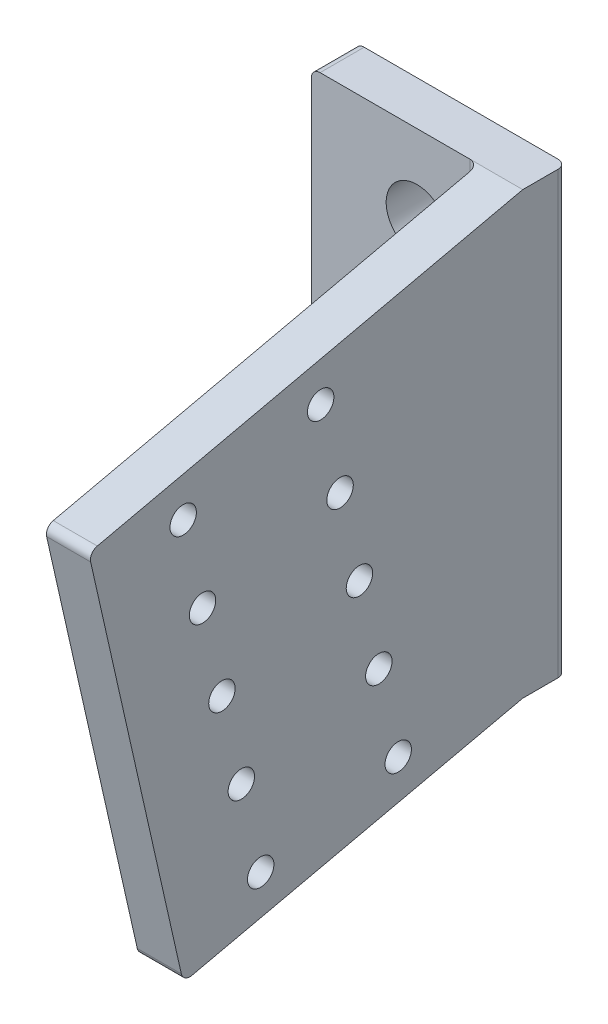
ISO-10303-21;
HEADER;
FILE_DESCRIPTION(('STEP AP214'),'2;1');
FILE_NAME('part.step','',(''),(''),'','','');
FILE_SCHEMA(('AUTOMOTIVE_DESIGN { 1 0 10303 214 1 1 1 1 }'));
ENDSEC;
DATA;
#1=APPLICATION_CONTEXT('core data for automotive mechanical design processes');
#2=APPLICATION_PROTOCOL_DEFINITION('international standard','automotive_design',2000,#1);
#3=PRODUCT_CONTEXT('',#1,'mechanical');
#4=PRODUCT('Part','Part','',(#3));
#5=PRODUCT_RELATED_PRODUCT_CATEGORY('part','',(#4));
#6=PRODUCT_DEFINITION_FORMATION('','',#4);
#7=PRODUCT_DEFINITION_CONTEXT('part definition',#1,'design');
#8=PRODUCT_DEFINITION('design','',#6,#7);
#9=PRODUCT_DEFINITION_SHAPE('','',#8);
#10=(LENGTH_UNIT() NAMED_UNIT(*) SI_UNIT(.MILLI.,.METRE.));
#11=(NAMED_UNIT(*) PLANE_ANGLE_UNIT() SI_UNIT($,.RADIAN.));
#12=(NAMED_UNIT(*) SI_UNIT($,.STERADIAN.) SOLID_ANGLE_UNIT());
#13=UNCERTAINTY_MEASURE_WITH_UNIT(LENGTH_MEASURE(1.E-05),#10,'distance_accuracy_value','');
#14=(GEOMETRIC_REPRESENTATION_CONTEXT(3) GLOBAL_UNCERTAINTY_ASSIGNED_CONTEXT((#13)) GLOBAL_UNIT_ASSIGNED_CONTEXT((#10,
#11,#12)) REPRESENTATION_CONTEXT('',''));
#15=CARTESIAN_POINT('',(0.,0.,0.));
#16=DIRECTION('',(0.,0.,1.));
#17=DIRECTION('',(1.,0.,0.));
#18=AXIS2_PLACEMENT_3D('',#15,#16,#17);
#19=CARTESIAN_POINT('',(-92.5,0.,5.));
#20=DIRECTION('',(-1.,0.,0.));
#21=DIRECTION('',(0.,0.,1.));
#22=AXIS2_PLACEMENT_3D('',#19,#20,#21);
#23=PLANE('',#22);
#24=CARTESIAN_POINT('',(-92.5,5.57499871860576,25.7344975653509));
#25=DIRECTION('',(-1.,0.,0.));
#26=DIRECTION('',(0.,0.,1.));
#27=AXIS2_PLACEMENT_3D('',#24,#25,#26);
#28=CIRCLE('',#27,1.5);
#29=CARTESIAN_POINT('',(-92.5,5.57499871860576,27.2344975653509));
#30=VERTEX_POINT('',#29);
#31=EDGE_CURVE('E298',#30,#30,#28,.T.);
#32=ORIENTED_EDGE('',*,*,#31,.T.);
#33=EDGE_LOOP('',(#32));
#34=FACE_BOUND('',#33,.T.);
#35=CARTESIAN_POINT('',(-92.5,-13.9349987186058,21.3344975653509));
#36=DIRECTION('',(-1.,0.,0.));
#37=DIRECTION('',(0.,0.,1.));
#38=AXIS2_PLACEMENT_3D('',#35,#36,#37);
#39=CIRCLE('',#38,1.5);
#40=CARTESIAN_POINT('',(-92.5,-13.9349987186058,22.8344975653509));
#41=VERTEX_POINT('',#40);
#42=EDGE_CURVE('E282',#41,#41,#39,.T.);
#43=ORIENTED_EDGE('',*,*,#42,.T.);
#44=EDGE_LOOP('',(#43));
#45=FACE_BOUND('',#44,.T.);
#46=DIRECTION('',(0.,0.,-1.));
#47=VECTOR('',#46,1.);
#48=CARTESIAN_POINT('',(-92.5,-24.9999999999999,5.));
#49=LINE('',#48,#47);
#50=CARTESIAN_POINT('',(-92.5,-24.9999999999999,5.));
#51=VERTEX_POINT('',#50);
#52=CARTESIAN_POINT('',(-92.5,-24.9999999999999,1.));
#53=VERTEX_POINT('',#52);
#54=EDGE_CURVE('E204',#51,#53,#49,.T.);
#55=ORIENTED_EDGE('',*,*,#54,.T.);
#56=DIRECTION('',(0.,1.,0.));
#57=VECTOR('',#56,1.);
#58=CARTESIAN_POINT('',(-92.5,0.,1.));
#59=LINE('',#58,#57);
#60=CARTESIAN_POINT('',(-92.5,24.9999999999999,1.));
#61=VERTEX_POINT('',#60);
#62=EDGE_CURVE('E202',#53,#61,#59,.T.);
#63=ORIENTED_EDGE('',*,*,#62,.T.);
#64=DIRECTION('',(0.,0.,-1.));
#65=VECTOR('',#64,1.);
#66=CARTESIAN_POINT('',(-92.5,24.9999999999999,5.));
#67=LINE('',#66,#65);
#68=CARTESIAN_POINT('',(-92.5,25.,5.));
#69=VERTEX_POINT('',#68);
#70=EDGE_CURVE('E198',#69,#61,#67,.T.);
#71=ORIENTED_EDGE('',*,*,#70,.F.);
#72=DIRECTION('',(0.,0.220000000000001,-0.975499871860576));
#73=VECTOR('',#72,1.);
#74=CARTESIAN_POINT('',(-92.5,23.7899999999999,10.3652492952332));
#75=LINE('',#74,#73);
#76=CARTESIAN_POINT('',(-92.5,14.1099999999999,53.2872436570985));
#77=VERTEX_POINT('',#76);
#78=EDGE_CURVE('E183',#77,#69,#75,.T.);
#79=ORIENTED_EDGE('',*,*,#78,.F.);
#80=CARTESIAN_POINT('',(-92.5,13.1345001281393,53.0672436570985));
#81=DIRECTION('',(-1.,0.,0.));
#82=DIRECTION('',(0.,0.,1.));
#83=AXIS2_PLACEMENT_3D('',#80,#81,#82);
#84=CIRCLE('',#83,1.);
#85=CARTESIAN_POINT('',(-92.5,12.9145001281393,54.0427435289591));
#86=VERTEX_POINT('',#85);
#87=EDGE_CURVE('E330',#77,#86,#84,.F.);
#88=ORIENTED_EDGE('',*,*,#87,.T.);
#89=DIRECTION('',(0.,-0.975499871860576,-0.220000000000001));
#90=VECTOR('',#89,1.);
#91=CARTESIAN_POINT('',(-92.5,-9.90000000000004,48.8974942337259));
#92=LINE('',#91,#90);
#93=CARTESIAN_POINT('',(-92.5,-32.7145001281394,43.7522449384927));
#94=VERTEX_POINT('',#93);
#95=EDGE_CURVE('E274',#86,#94,#92,.T.);
#96=ORIENTED_EDGE('',*,*,#95,.T.);
#97=CARTESIAN_POINT('',(-92.5,-32.4945001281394,42.7767450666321));
#98=DIRECTION('',(-1.,0.,0.));
#99=DIRECTION('',(0.,0.,1.));
#100=AXIS2_PLACEMENT_3D('',#97,#98,#99);
#101=CIRCLE('',#100,1.);
#102=CARTESIAN_POINT('',(-92.5,-33.47,42.5567450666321));
#103=VERTEX_POINT('',#102);
#104=EDGE_CURVE('E332',#94,#103,#101,.F.);
#105=ORIENTED_EDGE('',*,*,#104,.T.);
#106=DIRECTION('',(0.,0.220000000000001,-0.975499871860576));
#107=VECTOR('',#106,1.);
#108=CARTESIAN_POINT('',(-92.5,-23.7899999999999,-0.365249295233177));
#109=LINE('',#108,#107);
#110=EDGE_CURVE('E194',#103,#51,#109,.T.);
#111=ORIENTED_EDGE('',*,*,#110,.T.);
#112=EDGE_LOOP('',(#55,#63,#71,#79,#88,#96,#105,#111));
#113=FACE_BOUND('',#112,.T.);
#114=CARTESIAN_POINT('',(-92.5,-27.2099974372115,34.7424955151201));
#115=DIRECTION('',(-1.,0.,0.));
#116=DIRECTION('',(0.,0.,1.));
#117=AXIS2_PLACEMENT_3D('',#114,#115,#116);
#118=CIRCLE('',#117,1.5);
#119=CARTESIAN_POINT('',(-92.5,-27.2099974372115,36.2424955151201));
#120=VERTEX_POINT('',#119);
#121=EDGE_CURVE('E273',#120,#120,#118,.F.);
#122=ORIENTED_EDGE('',*,*,#121,.F.);
#123=EDGE_LOOP('',(#122));
#124=FACE_BOUND('',#123,.T.);
#125=CARTESIAN_POINT('',(-92.5,-23.6899974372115,19.1344975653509));
#126=DIRECTION('',(-1.,0.,0.));
#127=DIRECTION('',(0.,0.,1.));
#128=AXIS2_PLACEMENT_3D('',#125,#126,#127);
#129=CIRCLE('',#128,1.5);
#130=CARTESIAN_POINT('',(-92.5,-23.6899974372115,20.6344975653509));
#131=VERTEX_POINT('',#130);
#132=EDGE_CURVE('E278',#131,#131,#129,.T.);
#133=ORIENTED_EDGE('',*,*,#132,.T.);
#134=EDGE_LOOP('',(#133));
#135=FACE_BOUND('',#134,.T.);
#136=CARTESIAN_POINT('',(-92.5,-17.4549987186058,36.9424955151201));
#137=DIRECTION('',(-1.,0.,0.));
#138=DIRECTION('',(0.,0.,1.));
#139=AXIS2_PLACEMENT_3D('',#136,#137,#138);
#140=CIRCLE('',#139,1.5);
#141=CARTESIAN_POINT('',(-92.5,-17.4549987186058,38.4424955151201));
#142=VERTEX_POINT('',#141);
#143=EDGE_CURVE('E286',#142,#142,#140,.F.);
#144=ORIENTED_EDGE('',*,*,#143,.F.);
#145=EDGE_LOOP('',(#144));
#146=FACE_BOUND('',#145,.T.);
#147=CARTESIAN_POINT('',(-92.5,-7.70000000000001,39.1424955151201));
#148=DIRECTION('',(-1.,0.,0.));
#149=DIRECTION('',(0.,0.,1.));
#150=AXIS2_PLACEMENT_3D('',#147,#148,#149);
#151=CIRCLE('',#150,1.5);
#152=CARTESIAN_POINT('',(-92.5,-7.70000000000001,40.6424955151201));
#153=VERTEX_POINT('',#152);
#154=EDGE_CURVE('E290',#153,#153,#151,.F.);
#155=ORIENTED_EDGE('',*,*,#154,.F.);
#156=EDGE_LOOP('',(#155));
#157=FACE_BOUND('',#156,.T.);
#158=CARTESIAN_POINT('',(-92.5,-4.18,23.5344975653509));
#159=DIRECTION('',(-1.,0.,0.));
#160=DIRECTION('',(0.,0.,1.));
#161=AXIS2_PLACEMENT_3D('',#158,#159,#160);
#162=CIRCLE('',#161,1.5);
#163=CARTESIAN_POINT('',(-92.5,-4.18,25.0344975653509));
#164=VERTEX_POINT('',#163);
#165=EDGE_CURVE('E294',#164,#164,#162,.T.);
#166=ORIENTED_EDGE('',*,*,#165,.T.);
#167=EDGE_LOOP('',(#166));
#168=FACE_BOUND('',#167,.T.);
#169=CARTESIAN_POINT('',(-92.5,2.05499871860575,41.3424955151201));
#170=DIRECTION('',(-1.,0.,0.));
#171=DIRECTION('',(0.,0.,1.));
#172=AXIS2_PLACEMENT_3D('',#169,#170,#171);
#173=CIRCLE('',#172,1.5);
#174=CARTESIAN_POINT('',(-92.5,2.05499871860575,42.8424955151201));
#175=VERTEX_POINT('',#174);
#176=EDGE_CURVE('E302',#175,#175,#173,.F.);
#177=ORIENTED_EDGE('',*,*,#176,.F.);
#178=EDGE_LOOP('',(#177));
#179=FACE_BOUND('',#178,.T.);
#180=CARTESIAN_POINT('',(-92.5,11.8099974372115,43.5424955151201));
#181=DIRECTION('',(-1.,0.,0.));
#182=DIRECTION('',(0.,0.,1.));
#183=AXIS2_PLACEMENT_3D('',#180,#181,#182);
#184=CIRCLE('',#183,1.5);
#185=CARTESIAN_POINT('',(-92.5,11.8099974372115,45.0424955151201));
#186=VERTEX_POINT('',#185);
#187=EDGE_CURVE('E306',#186,#186,#184,.F.);
#188=ORIENTED_EDGE('',*,*,#187,.F.);
#189=EDGE_LOOP('',(#188));
#190=FACE_BOUND('',#189,.T.);
#191=CARTESIAN_POINT('',(-92.5,15.3299974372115,27.934497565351));
#192=DIRECTION('',(-1.,0.,0.));
#193=DIRECTION('',(0.,0.,1.));
#194=AXIS2_PLACEMENT_3D('',#191,#192,#193);
#195=CIRCLE('',#194,1.5);
#196=CARTESIAN_POINT('',(-92.5,15.3299974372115,29.434497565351));
#197=VERTEX_POINT('',#196);
#198=EDGE_CURVE('E310',#197,#197,#195,.T.);
#199=ORIENTED_EDGE('',*,*,#198,.T.);
#200=EDGE_LOOP('',(#199));
#201=FACE_BOUND('',#200,.T.);
#202=ADVANCED_FACE('F43',(#34,#45,#113,#124,#135,#146,#157,#168,#179,#190,#201),#23,.F.);
#203=CARTESIAN_POINT('',(-97.5,0.,0.));
#204=DIRECTION('',(-1.,0.,0.));
#205=DIRECTION('',(0.,0.,1.));
#206=AXIS2_PLACEMENT_3D('',#203,#204,#205);
#207=PLANE('',#206);
#208=DIRECTION('',(0.,0.220000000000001,-0.975499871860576));
#209=VECTOR('',#208,1.);
#210=CARTESIAN_POINT('',(-97.5,-23.7899999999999,-0.365249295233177));
#211=LINE('',#210,#209);
#212=CARTESIAN_POINT('',(-97.5,-33.47,42.5567450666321));
#213=VERTEX_POINT('',#212);
#214=CARTESIAN_POINT('',(-97.5,-25.2255254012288,6.));
#215=VERTEX_POINT('',#214);
#216=EDGE_CURVE('E193',#213,#215,#211,.T.);
#217=ORIENTED_EDGE('',*,*,#216,.F.);
#218=CARTESIAN_POINT('',(-97.5,-32.4945001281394,42.7767450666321));
#219=DIRECTION('',(-1.,0.,0.));
#220=DIRECTION('',(0.,0.,1.));
#221=AXIS2_PLACEMENT_3D('',#218,#219,#220);
#222=CIRCLE('',#221,1.);
#223=CARTESIAN_POINT('',(-97.5,-32.7145001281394,43.7522449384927));
#224=VERTEX_POINT('',#223);
#225=EDGE_CURVE('E369',#213,#224,#222,.T.);
#226=ORIENTED_EDGE('',*,*,#225,.T.);
#227=DIRECTION('',(0.,-0.975499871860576,-0.220000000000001));
#228=VECTOR('',#227,1.);
#229=CARTESIAN_POINT('',(-97.5,-10.9730498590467,48.6554942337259));
#230=LINE('',#229,#228);
#231=CARTESIAN_POINT('',(-97.5,12.9145001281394,54.0427435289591));
#232=VERTEX_POINT('',#231);
#233=EDGE_CURVE('E453',#232,#224,#230,.T.);
#234=ORIENTED_EDGE('',*,*,#233,.F.);
#235=CARTESIAN_POINT('',(-97.5,13.1345001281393,53.0672436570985));
#236=DIRECTION('',(-1.,0.,0.));
#237=DIRECTION('',(0.,0.,1.));
#238=AXIS2_PLACEMENT_3D('',#235,#236,#237);
#239=CIRCLE('',#238,1.);
#240=CARTESIAN_POINT('',(-97.5,14.1099999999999,53.2872436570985));
#241=VERTEX_POINT('',#240);
#242=EDGE_CURVE('E367',#232,#241,#239,.T.);
#243=ORIENTED_EDGE('',*,*,#242,.T.);
#244=DIRECTION('',(0.,0.220000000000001,-0.975499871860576));
#245=VECTOR('',#244,1.);
#246=CARTESIAN_POINT('',(-97.5,23.7899999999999,10.3652492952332));
#247=LINE('',#246,#245);
#248=CARTESIAN_POINT('',(-97.5,24.7744745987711,6.));
#249=VERTEX_POINT('',#248);
#250=EDGE_CURVE('E213',#241,#249,#247,.T.);
#251=ORIENTED_EDGE('',*,*,#250,.T.);
#252=DIRECTION('',(0.,-1.,0.));
#253=VECTOR('',#252,1.);
#254=CARTESIAN_POINT('',(-97.5,-24.9999999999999,6.));
#255=LINE('',#254,#253);
#256=EDGE_CURVE('E364',#249,#215,#255,.T.);
#257=ORIENTED_EDGE('',*,*,#256,.T.);
#258=EDGE_LOOP('',(#217,#226,#234,#243,#251,#257));
#259=FACE_BOUND('',#258,.T.);
#260=CARTESIAN_POINT('',(-97.5,11.8099974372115,43.5424955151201));
#261=DIRECTION('',(-1.,0.,0.));
#262=DIRECTION('',(0.,0.,1.));
#263=AXIS2_PLACEMENT_3D('',#260,#261,#262);
#264=CIRCLE('',#263,1.5);
#265=CARTESIAN_POINT('',(-97.5,11.8099974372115,45.0424955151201));
#266=VERTEX_POINT('',#265);
#267=EDGE_CURVE('E303',#266,#266,#264,.F.);
#268=ORIENTED_EDGE('',*,*,#267,.T.);
#269=EDGE_LOOP('',(#268));
#270=FACE_BOUND('',#269,.T.);
#271=CARTESIAN_POINT('',(-97.5,2.05499871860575,41.3424955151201));
#272=DIRECTION('',(-1.,0.,0.));
#273=DIRECTION('',(0.,0.,1.));
#274=AXIS2_PLACEMENT_3D('',#271,#272,#273);
#275=CIRCLE('',#274,1.5);
#276=CARTESIAN_POINT('',(-97.5,2.05499871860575,42.8424955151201));
#277=VERTEX_POINT('',#276);
#278=EDGE_CURVE('E299',#277,#277,#275,.F.);
#279=ORIENTED_EDGE('',*,*,#278,.T.);
#280=EDGE_LOOP('',(#279));
#281=FACE_BOUND('',#280,.T.);
#282=CARTESIAN_POINT('',(-97.5,-7.70000000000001,39.1424955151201));
#283=DIRECTION('',(-1.,0.,0.));
#284=DIRECTION('',(0.,0.,1.));
#285=AXIS2_PLACEMENT_3D('',#282,#283,#284);
#286=CIRCLE('',#285,1.5);
#287=CARTESIAN_POINT('',(-97.5,-7.70000000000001,40.6424955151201));
#288=VERTEX_POINT('',#287);
#289=EDGE_CURVE('E287',#288,#288,#286,.F.);
#290=ORIENTED_EDGE('',*,*,#289,.T.);
#291=EDGE_LOOP('',(#290));
#292=FACE_BOUND('',#291,.T.);
#293=CARTESIAN_POINT('',(-97.5,-17.4549987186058,36.9424955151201));
#294=DIRECTION('',(-1.,0.,0.));
#295=DIRECTION('',(0.,0.,1.));
#296=AXIS2_PLACEMENT_3D('',#293,#294,#295);
#297=CIRCLE('',#296,1.5);
#298=CARTESIAN_POINT('',(-97.5,-17.4549987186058,38.4424955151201));
#299=VERTEX_POINT('',#298);
#300=EDGE_CURVE('E283',#299,#299,#297,.F.);
#301=ORIENTED_EDGE('',*,*,#300,.T.);
#302=EDGE_LOOP('',(#301));
#303=FACE_BOUND('',#302,.T.);
#304=CARTESIAN_POINT('',(-97.5,-27.2099974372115,34.7424955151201));
#305=DIRECTION('',(-1.,0.,0.));
#306=DIRECTION('',(0.,0.,1.));
#307=AXIS2_PLACEMENT_3D('',#304,#305,#306);
#308=CIRCLE('',#307,1.5);
#309=CARTESIAN_POINT('',(-97.5,-27.2099974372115,36.2424955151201));
#310=VERTEX_POINT('',#309);
#311=EDGE_CURVE('E270',#310,#310,#308,.F.);
#312=ORIENTED_EDGE('',*,*,#311,.T.);
#313=EDGE_LOOP('',(#312));
#314=FACE_BOUND('',#313,.T.);
#315=CARTESIAN_POINT('',(-97.5,-23.6899974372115,19.1344975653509));
#316=DIRECTION('',(-1.,0.,0.));
#317=DIRECTION('',(0.,0.,1.));
#318=AXIS2_PLACEMENT_3D('',#315,#316,#317);
#319=CIRCLE('',#318,1.5);
#320=CARTESIAN_POINT('',(-97.5,-23.6899974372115,20.6344975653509));
#321=VERTEX_POINT('',#320);
#322=EDGE_CURVE('E275',#321,#321,#319,.T.);
#323=ORIENTED_EDGE('',*,*,#322,.F.);
#324=EDGE_LOOP('',(#323));
#325=FACE_BOUND('',#324,.T.);
#326=CARTESIAN_POINT('',(-97.5,-13.9349987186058,21.3344975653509));
#327=DIRECTION('',(-1.,0.,0.));
#328=DIRECTION('',(0.,0.,1.));
#329=AXIS2_PLACEMENT_3D('',#326,#327,#328);
#330=CIRCLE('',#329,1.5);
#331=CARTESIAN_POINT('',(-97.5,-13.9349987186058,22.8344975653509));
#332=VERTEX_POINT('',#331);
#333=EDGE_CURVE('E279',#332,#332,#330,.T.);
#334=ORIENTED_EDGE('',*,*,#333,.F.);
#335=EDGE_LOOP('',(#334));
#336=FACE_BOUND('',#335,.T.);
#337=CARTESIAN_POINT('',(-97.5,-4.18,23.5344975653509));
#338=DIRECTION('',(-1.,0.,0.));
#339=DIRECTION('',(0.,0.,1.));
#340=AXIS2_PLACEMENT_3D('',#337,#338,#339);
#341=CIRCLE('',#340,1.5);
#342=CARTESIAN_POINT('',(-97.5,-4.18,25.0344975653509));
#343=VERTEX_POINT('',#342);
#344=EDGE_CURVE('E291',#343,#343,#341,.T.);
#345=ORIENTED_EDGE('',*,*,#344,.F.);
#346=EDGE_LOOP('',(#345));
#347=FACE_BOUND('',#346,.T.);
#348=CARTESIAN_POINT('',(-97.5,5.57499871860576,25.7344975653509));
#349=DIRECTION('',(-1.,0.,0.));
#350=DIRECTION('',(0.,0.,1.));
#351=AXIS2_PLACEMENT_3D('',#348,#349,#350);
#352=CIRCLE('',#351,1.5);
#353=CARTESIAN_POINT('',(-97.5,5.57499871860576,27.2344975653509));
#354=VERTEX_POINT('',#353);
#355=EDGE_CURVE('E295',#354,#354,#352,.T.);
#356=ORIENTED_EDGE('',*,*,#355,.F.);
#357=EDGE_LOOP('',(#356));
#358=FACE_BOUND('',#357,.T.);
#359=CARTESIAN_POINT('',(-97.5,15.3299974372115,27.934497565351));
#360=DIRECTION('',(-1.,0.,0.));
#361=DIRECTION('',(0.,0.,1.));
#362=AXIS2_PLACEMENT_3D('',#359,#360,#361);
#363=CIRCLE('',#362,1.5);
#364=CARTESIAN_POINT('',(-97.5,15.3299974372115,29.434497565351));
#365=VERTEX_POINT('',#364);
#366=EDGE_CURVE('E307',#365,#365,#363,.T.);
#367=ORIENTED_EDGE('',*,*,#366,.F.);
#368=EDGE_LOOP('',(#367));
#369=FACE_BOUND('',#368,.T.);
#370=ADVANCED_FACE('F465',(#259,#270,#281,#292,#303,#314,#325,#336,#347,#358,#369),#207,.T.);
#371=CARTESIAN_POINT('',(0.,-24.9999999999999,5.));
#372=DIRECTION('',(0.,-1.,0.));
#373=DIRECTION('',(0.,0.,-1.));
#374=AXIS2_PLACEMENT_3D('',#371,#372,#373);
#375=PLANE('',#374);
#376=DIRECTION('',(-1.,0.,0.));
#377=VECTOR('',#376,1.);
#378=CARTESIAN_POINT('',(0.,-24.9999999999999,0.));
#379=LINE('',#378,#377);
#380=CARTESIAN_POINT('',(-93.5,-24.9999999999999,0.));
#381=VERTEX_POINT('',#380);
#382=CARTESIAN_POINT('',(-115.5,-24.9999999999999,0.));
#383=VERTEX_POINT('',#382);
#384=EDGE_CURVE('E254',#381,#383,#379,.T.);
#385=ORIENTED_EDGE('',*,*,#384,.F.);
#386=CARTESIAN_POINT('',(-93.5,-24.9999999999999,1.));
#387=DIRECTION('',(0.,-1.,0.));
#388=DIRECTION('',(0.,0.,-1.));
#389=AXIS2_PLACEMENT_3D('',#386,#387,#388);
#390=CIRCLE('',#389,1.);
#391=EDGE_CURVE('E348',#381,#53,#390,.T.);
#392=ORIENTED_EDGE('',*,*,#391,.T.);
#393=ORIENTED_EDGE('',*,*,#54,.F.);
#394=DIRECTION('',(-1.,0.,0.));
#395=VECTOR('',#394,1.);
#396=CARTESIAN_POINT('',(0.,-24.9999999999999,5.));
#397=LINE('',#396,#395);
#398=CARTESIAN_POINT('',(-98.5,-24.9999999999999,5.));
#399=VERTEX_POINT('',#398);
#400=EDGE_CURVE('E59',#51,#399,#397,.T.);
#401=ORIENTED_EDGE('',*,*,#400,.T.);
#402=CARTESIAN_POINT('',(-115.5,-24.9999999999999,5.));
#403=VERTEX_POINT('',#402);
#404=EDGE_CURVE('E235',#399,#403,#397,.T.);
#405=ORIENTED_EDGE('',*,*,#404,.T.);
#406=DIRECTION('',(0.,0.,-1.));
#407=VECTOR('',#406,1.);
#408=CARTESIAN_POINT('',(-115.5,-24.9999999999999,5.));
#409=LINE('',#408,#407);
#410=EDGE_CURVE('E345',#403,#383,#409,.T.);
#411=ORIENTED_EDGE('',*,*,#410,.T.);
#412=EDGE_LOOP('',(#385,#392,#393,#401,#405,#411));
#413=FACE_BOUND('',#412,.T.);
#414=ADVANCED_FACE('F408',(#413),#375,.T.);
#415=CARTESIAN_POINT('',(0.,24.9999999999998,5.));
#416=DIRECTION('',(0.,1.,0.));
#417=DIRECTION('',(-1.,0.,0.));
#418=AXIS2_PLACEMENT_3D('',#415,#416,#417);
#419=PLANE('',#418);
#420=ORIENTED_EDGE('',*,*,#70,.T.);
#421=CARTESIAN_POINT('',(-93.5,24.9999999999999,1.));
#422=DIRECTION('',(0.,1.,0.));
#423=DIRECTION('',(-1.,0.,0.));
#424=AXIS2_PLACEMENT_3D('',#421,#422,#423);
#425=CIRCLE('',#424,1.);
#426=CARTESIAN_POINT('',(-93.5,24.9999999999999,0.));
#427=VERTEX_POINT('',#426);
#428=EDGE_CURVE('E337',#61,#427,#425,.T.);
#429=ORIENTED_EDGE('',*,*,#428,.T.);
#430=DIRECTION('',(1.,0.,0.));
#431=VECTOR('',#430,1.);
#432=CARTESIAN_POINT('',(0.,24.9999999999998,0.));
#433=LINE('',#432,#431);
#434=CARTESIAN_POINT('',(-115.5,25.,0.));
#435=VERTEX_POINT('',#434);
#436=EDGE_CURVE('E257',#435,#427,#433,.T.);
#437=ORIENTED_EDGE('',*,*,#436,.F.);
#438=DIRECTION('',(0.,0.,-1.));
#439=VECTOR('',#438,1.);
#440=CARTESIAN_POINT('',(-115.5,25.,5.));
#441=LINE('',#440,#439);
#442=CARTESIAN_POINT('',(-115.5,25.,5.));
#443=VERTEX_POINT('',#442);
#444=EDGE_CURVE('E335',#435,#443,#441,.F.);
#445=ORIENTED_EDGE('',*,*,#444,.T.);
#446=DIRECTION('',(1.,0.,0.));
#447=VECTOR('',#446,1.);
#448=CARTESIAN_POINT('',(0.,24.9999999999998,5.));
#449=LINE('',#448,#447);
#450=CARTESIAN_POINT('',(-98.5,25.,5.));
#451=VERTEX_POINT('',#450);
#452=EDGE_CURVE('E210',#443,#451,#449,.T.);
#453=ORIENTED_EDGE('',*,*,#452,.T.);
#454=DIRECTION('',(1.,0.,0.));
#455=VECTOR('',#454,1.);
#456=CARTESIAN_POINT('',(-97.5,25.,5.));
#457=LINE('',#456,#455);
#458=EDGE_CURVE('E188',#451,#69,#457,.T.);
#459=ORIENTED_EDGE('',*,*,#458,.T.);
#460=EDGE_LOOP('',(#420,#429,#437,#445,#453,#459));
#461=FACE_BOUND('',#460,.T.);
#462=ADVANCED_FACE('F208',(#461),#419,.T.);
#463=CARTESIAN_POINT('',(0.,7.50000000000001,5.));
#464=DIRECTION('',(0.,1.,0.));
#465=DIRECTION('',(0.,0.,1.));
#466=AXIS2_PLACEMENT_3D('',#463,#464,#465);
#467=PLANE('',#466);
#468=DIRECTION('',(1.,0.,0.));
#469=VECTOR('',#468,1.);
#470=CARTESIAN_POINT('',(0.,7.50000000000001,0.));
#471=LINE('',#470,#469);
#472=CARTESIAN_POINT('',(-108.5,7.50000000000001,0.));
#473=VERTEX_POINT('',#472);
#474=CARTESIAN_POINT('',(-100.5,7.50000000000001,0.));
#475=VERTEX_POINT('',#474);
#476=EDGE_CURVE('E212',#473,#475,#471,.T.);
#477=ORIENTED_EDGE('',*,*,#476,.T.);
#478=DIRECTION('',(0.,0.,-1.));
#479=VECTOR('',#478,1.);
#480=CARTESIAN_POINT('',(-100.5,7.50000000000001,5.));
#481=LINE('',#480,#479);
#482=CARTESIAN_POINT('',(-100.5,7.50000000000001,5.));
#483=VERTEX_POINT('',#482);
#484=EDGE_CURVE('E323',#475,#483,#481,.F.);
#485=ORIENTED_EDGE('',*,*,#484,.T.);
#486=DIRECTION('',(1.,0.,0.));
#487=VECTOR('',#486,1.);
#488=CARTESIAN_POINT('',(0.,7.50000000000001,5.));
#489=LINE('',#488,#487);
#490=CARTESIAN_POINT('',(-108.5,7.50000000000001,5.));
#491=VERTEX_POINT('',#490);
#492=EDGE_CURVE('E222',#491,#483,#489,.T.);
#493=ORIENTED_EDGE('',*,*,#492,.F.);
#494=DIRECTION('',(0.,0.,-1.));
#495=VECTOR('',#494,1.);
#496=CARTESIAN_POINT('',(-108.5,7.50000000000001,5.));
#497=LINE('',#496,#495);
#498=EDGE_CURVE('E320',#491,#473,#497,.T.);
#499=ORIENTED_EDGE('',*,*,#498,.T.);
#500=EDGE_LOOP('',(#477,#485,#493,#499));
#501=FACE_BOUND('',#500,.T.);
#502=ADVANCED_FACE('F502',(#501),#467,.F.);
#503=CARTESIAN_POINT('',(-99.5,0.,5.));
#504=DIRECTION('',(1.,0.,0.));
#505=DIRECTION('',(0.,0.,-1.));
#506=AXIS2_PLACEMENT_3D('',#503,#504,#505);
#507=PLANE('',#506);
#508=DIRECTION('',(0.,-1.,0.));
#509=VECTOR('',#508,1.);
#510=CARTESIAN_POINT('',(-99.5,0.,0.));
#511=LINE('',#510,#509);
#512=CARTESIAN_POINT('',(-99.5,6.50000000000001,0.));
#513=VERTEX_POINT('',#512);
#514=CARTESIAN_POINT('',(-99.5,-6.5,0.));
#515=VERTEX_POINT('',#514);
#516=EDGE_CURVE('E216',#513,#515,#511,.T.);
#517=ORIENTED_EDGE('',*,*,#516,.T.);
#518=DIRECTION('',(0.,0.,-1.));
#519=VECTOR('',#518,1.);
#520=CARTESIAN_POINT('',(-99.5,-6.5,5.));
#521=LINE('',#520,#519);
#522=CARTESIAN_POINT('',(-99.5,-6.5,5.));
#523=VERTEX_POINT('',#522);
#524=EDGE_CURVE('E318',#515,#523,#521,.F.);
#525=ORIENTED_EDGE('',*,*,#524,.T.);
#526=DIRECTION('',(0.,-1.,0.));
#527=VECTOR('',#526,1.);
#528=CARTESIAN_POINT('',(-99.5,0.,5.));
#529=LINE('',#528,#527);
#530=CARTESIAN_POINT('',(-99.5,6.50000000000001,5.));
#531=VERTEX_POINT('',#530);
#532=EDGE_CURVE('E225',#531,#523,#529,.T.);
#533=ORIENTED_EDGE('',*,*,#532,.F.);
#534=DIRECTION('',(0.,0.,-1.));
#535=VECTOR('',#534,1.);
#536=CARTESIAN_POINT('',(-99.5,6.50000000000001,0.));
#537=LINE('',#536,#535);
#538=EDGE_CURVE('E315',#531,#513,#537,.T.);
#539=ORIENTED_EDGE('',*,*,#538,.T.);
#540=EDGE_LOOP('',(#517,#525,#533,#539));
#541=FACE_BOUND('',#540,.T.);
#542=ADVANCED_FACE('F498',(#541),#507,.F.);
#543=CARTESIAN_POINT('',(0.,-7.5,5.));
#544=DIRECTION('',(0.,1.,0.));
#545=DIRECTION('',(0.,0.,1.));
#546=AXIS2_PLACEMENT_3D('',#543,#544,#545);
#547=PLANE('',#546);
#548=DIRECTION('',(1.,0.,0.));
#549=VECTOR('',#548,1.);
#550=CARTESIAN_POINT('',(0.,-7.5,5.));
#551=LINE('',#550,#549);
#552=CARTESIAN_POINT('',(-108.5,-7.5,5.));
#553=VERTEX_POINT('',#552);
#554=CARTESIAN_POINT('',(-100.5,-7.5,5.));
#555=VERTEX_POINT('',#554);
#556=EDGE_CURVE('E229',#553,#555,#551,.T.);
#557=ORIENTED_EDGE('',*,*,#556,.T.);
#558=DIRECTION('',(0.,0.,-1.));
#559=VECTOR('',#558,1.);
#560=CARTESIAN_POINT('',(-100.5,-7.5,5.));
#561=LINE('',#560,#559);
#562=CARTESIAN_POINT('',(-100.5,-7.5,0.));
#563=VERTEX_POINT('',#562);
#564=EDGE_CURVE('E312',#555,#563,#561,.T.);
#565=ORIENTED_EDGE('',*,*,#564,.T.);
#566=DIRECTION('',(1.,0.,0.));
#567=VECTOR('',#566,1.);
#568=CARTESIAN_POINT('',(0.,-7.5,0.));
#569=LINE('',#568,#567);
#570=CARTESIAN_POINT('',(-108.5,-7.5,0.));
#571=VERTEX_POINT('',#570);
#572=EDGE_CURVE('E248',#571,#563,#569,.T.);
#573=ORIENTED_EDGE('',*,*,#572,.F.);
#574=DIRECTION('',(0.,0.,-1.));
#575=VECTOR('',#574,1.);
#576=CARTESIAN_POINT('',(-108.5,-7.5,5.));
#577=LINE('',#576,#575);
#578=EDGE_CURVE('E269',#571,#553,#577,.F.);
#579=ORIENTED_EDGE('',*,*,#578,.T.);
#580=EDGE_LOOP('',(#557,#565,#573,#579));
#581=FACE_BOUND('',#580,.T.);
#582=ADVANCED_FACE('F494',(#581),#547,.T.);
#583=CARTESIAN_POINT('',(-104.5,16.,5.));
#584=DIRECTION('',(0.,0.,-1.));
#585=DIRECTION('',(-1.,0.,0.));
#586=AXIS2_PLACEMENT_3D('',#583,#584,#585);
#587=CYLINDRICAL_SURFACE('',#586,3.49999999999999);
#588=CARTESIAN_POINT('',(-104.5,16.,5.));
#589=DIRECTION('',(0.,0.,1.));
#590=DIRECTION('',(1.,0.,0.));
#591=AXIS2_PLACEMENT_3D('',#588,#589,#590);
#592=CIRCLE('',#591,3.49999999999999);
#593=CARTESIAN_POINT('',(-101.,16.,5.));
#594=VERTEX_POINT('',#593);
#595=EDGE_CURVE('E241',#594,#594,#592,.T.);
#596=ORIENTED_EDGE('',*,*,#595,.T.);
#597=EDGE_LOOP('',(#596));
#598=FACE_BOUND('',#597,.T.);
#599=CARTESIAN_POINT('',(-104.5,16.,0.));
#600=DIRECTION('',(0.,0.,1.));
#601=DIRECTION('',(1.,0.,0.));
#602=AXIS2_PLACEMENT_3D('',#599,#600,#601);
#603=CIRCLE('',#602,3.49999999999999);
#604=CARTESIAN_POINT('',(-101.,16.,0.));
#605=VERTEX_POINT('',#604);
#606=EDGE_CURVE('E263',#605,#605,#603,.T.);
#607=ORIENTED_EDGE('',*,*,#606,.F.);
#608=EDGE_LOOP('',(#607));
#609=FACE_BOUND('',#608,.T.);
#610=ADVANCED_FACE('F497',(#598,#609),#587,.F.);
#611=CARTESIAN_POINT('',(-116.5,0.,5.));
#612=DIRECTION('',(-1.,0.,0.));
#613=DIRECTION('',(0.,0.,1.));
#614=AXIS2_PLACEMENT_3D('',#611,#612,#613);
#615=PLANE('',#614);
#616=DIRECTION('',(0.,1.,0.));
#617=VECTOR('',#616,1.);
#618=CARTESIAN_POINT('',(-116.5,0.,0.));
#619=LINE('',#618,#617);
#620=CARTESIAN_POINT('',(-116.5,-23.9999999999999,0.));
#621=VERTEX_POINT('',#620);
#622=CARTESIAN_POINT('',(-116.5,24.,0.));
#623=VERTEX_POINT('',#622);
#624=EDGE_CURVE('E260',#621,#623,#619,.T.);
#625=ORIENTED_EDGE('',*,*,#624,.F.);
#626=DIRECTION('',(0.,0.,-1.));
#627=VECTOR('',#626,1.);
#628=CARTESIAN_POINT('',(-116.5,-23.9999999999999,5.));
#629=LINE('',#628,#627);
#630=CARTESIAN_POINT('',(-116.5,-23.9999999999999,5.));
#631=VERTEX_POINT('',#630);
#632=EDGE_CURVE('E353',#621,#631,#629,.F.);
#633=ORIENTED_EDGE('',*,*,#632,.T.);
#634=DIRECTION('',(0.,1.,0.));
#635=VECTOR('',#634,1.);
#636=CARTESIAN_POINT('',(-116.5,0.,5.));
#637=LINE('',#636,#635);
#638=CARTESIAN_POINT('',(-116.5,24.,5.));
#639=VERTEX_POINT('',#638);
#640=EDGE_CURVE('E238',#631,#639,#637,.T.);
#641=ORIENTED_EDGE('',*,*,#640,.T.);
#642=DIRECTION('',(0.,0.,-1.));
#643=VECTOR('',#642,1.);
#644=CARTESIAN_POINT('',(-116.5,24.,5.));
#645=LINE('',#644,#643);
#646=EDGE_CURVE('E350',#639,#623,#645,.T.);
#647=ORIENTED_EDGE('',*,*,#646,.T.);
#648=EDGE_LOOP('',(#625,#633,#641,#647));
#649=FACE_BOUND('',#648,.T.);
#650=ADVANCED_FACE('F417',(#649),#615,.T.);
#651=CARTESIAN_POINT('',(-109.5,0.,5.));
#652=DIRECTION('',(1.,0.,0.));
#653=DIRECTION('',(0.,0.,-1.));
#654=AXIS2_PLACEMENT_3D('',#651,#652,#653);
#655=PLANE('',#654);
#656=DIRECTION('',(0.,-1.,0.));
#657=VECTOR('',#656,1.);
#658=CARTESIAN_POINT('',(-109.5,0.,0.));
#659=LINE('',#658,#657);
#660=CARTESIAN_POINT('',(-109.5,6.50000000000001,0.));
#661=VERTEX_POINT('',#660);
#662=CARTESIAN_POINT('',(-109.5,-6.5,0.));
#663=VERTEX_POINT('',#662);
#664=EDGE_CURVE('E251',#661,#663,#659,.T.);
#665=ORIENTED_EDGE('',*,*,#664,.F.);
#666=DIRECTION('',(0.,0.,-1.));
#667=VECTOR('',#666,1.);
#668=CARTESIAN_POINT('',(-109.5,6.50000000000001,5.));
#669=LINE('',#668,#667);
#670=CARTESIAN_POINT('',(-109.5,6.50000000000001,5.));
#671=VERTEX_POINT('',#670);
#672=EDGE_CURVE('E328',#661,#671,#669,.F.);
#673=ORIENTED_EDGE('',*,*,#672,.T.);
#674=DIRECTION('',(0.,-1.,0.));
#675=VECTOR('',#674,1.);
#676=CARTESIAN_POINT('',(-109.5,0.,5.));
#677=LINE('',#676,#675);
#678=CARTESIAN_POINT('',(-109.5,-6.5,5.));
#679=VERTEX_POINT('',#678);
#680=EDGE_CURVE('E232',#671,#679,#677,.T.);
#681=ORIENTED_EDGE('',*,*,#680,.T.);
#682=DIRECTION('',(0.,0.,-1.));
#683=VECTOR('',#682,1.);
#684=CARTESIAN_POINT('',(-109.5,-6.5,0.));
#685=LINE('',#684,#683);
#686=EDGE_CURVE('E325',#679,#663,#685,.T.);
#687=ORIENTED_EDGE('',*,*,#686,.T.);
#688=EDGE_LOOP('',(#665,#673,#681,#687));
#689=FACE_BOUND('',#688,.T.);
#690=ADVANCED_FACE('F489',(#689),#655,.T.);
#691=CARTESIAN_POINT('',(-104.5,-16.,5.));
#692=DIRECTION('',(0.,0.,-1.));
#693=DIRECTION('',(-1.,0.,0.));
#694=AXIS2_PLACEMENT_3D('',#691,#692,#693);
#695=CYLINDRICAL_SURFACE('',#694,3.49999999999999);
#696=CARTESIAN_POINT('',(-104.5,-16.,5.));
#697=DIRECTION('',(0.,0.,1.));
#698=DIRECTION('',(1.,0.,0.));
#699=AXIS2_PLACEMENT_3D('',#696,#697,#698);
#700=CIRCLE('',#699,3.49999999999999);
#701=CARTESIAN_POINT('',(-101.,-16.,5.));
#702=VERTEX_POINT('',#701);
#703=EDGE_CURVE('E205',#702,#702,#700,.F.);
#704=ORIENTED_EDGE('',*,*,#703,.F.);
#705=EDGE_LOOP('',(#704));
#706=FACE_BOUND('',#705,.T.);
#707=CARTESIAN_POINT('',(-104.5,-16.,0.));
#708=DIRECTION('',(0.,0.,1.));
#709=DIRECTION('',(1.,0.,0.));
#710=AXIS2_PLACEMENT_3D('',#707,#708,#709);
#711=CIRCLE('',#710,3.49999999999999);
#712=CARTESIAN_POINT('',(-101.,-16.,0.));
#713=VERTEX_POINT('',#712);
#714=EDGE_CURVE('E226',#713,#713,#711,.F.);
#715=ORIENTED_EDGE('',*,*,#714,.T.);
#716=EDGE_LOOP('',(#715));
#717=FACE_BOUND('',#716,.T.);
#718=ADVANCED_FACE('F492',(#706,#717),#695,.F.);
#719=CARTESIAN_POINT('',(0.,0.,5.));
#720=DIRECTION('',(0.,0.,1.));
#721=DIRECTION('',(1.,0.,0.));
#722=AXIS2_PLACEMENT_3D('',#719,#720,#721);
#723=PLANE('',#722);
#724=ORIENTED_EDGE('',*,*,#640,.F.);
#725=CARTESIAN_POINT('',(-115.5,-23.9999999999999,5.));
#726=DIRECTION('',(0.,0.,1.));
#727=DIRECTION('',(1.,0.,0.));
#728=AXIS2_PLACEMENT_3D('',#725,#726,#727);
#729=CIRCLE('',#728,1.);
#730=EDGE_CURVE('E359',#631,#403,#729,.T.);
#731=ORIENTED_EDGE('',*,*,#730,.T.);
#732=ORIENTED_EDGE('',*,*,#404,.F.);
#733=DIRECTION('',(0.,-1.,0.));
#734=VECTOR('',#733,1.);
#735=CARTESIAN_POINT('',(-98.5,24.9999999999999,5.));
#736=LINE('',#735,#734);
#737=EDGE_CURVE('E355',#399,#451,#736,.F.);
#738=ORIENTED_EDGE('',*,*,#737,.T.);
#739=ORIENTED_EDGE('',*,*,#452,.F.);
#740=CARTESIAN_POINT('',(-115.5,24.,5.));
#741=DIRECTION('',(0.,0.,1.));
#742=DIRECTION('',(1.,0.,0.));
#743=AXIS2_PLACEMENT_3D('',#740,#741,#742);
#744=CIRCLE('',#743,1.);
#745=EDGE_CURVE('E357',#443,#639,#744,.T.);
#746=ORIENTED_EDGE('',*,*,#745,.T.);
#747=EDGE_LOOP('',(#724,#731,#732,#738,#739,#746));
#748=FACE_BOUND('',#747,.T.);
#749=ORIENTED_EDGE('',*,*,#680,.F.);
#750=CARTESIAN_POINT('',(-108.5,6.50000000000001,5.));
#751=DIRECTION('',(0.,0.,1.));
#752=DIRECTION('',(1.,0.,0.));
#753=AXIS2_PLACEMENT_3D('',#750,#751,#752);
#754=CIRCLE('',#753,1.);
#755=EDGE_CURVE('E386',#671,#491,#754,.F.);
#756=ORIENTED_EDGE('',*,*,#755,.T.);
#757=ORIENTED_EDGE('',*,*,#492,.T.);
#758=CARTESIAN_POINT('',(-100.5,6.50000000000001,5.));
#759=DIRECTION('',(0.,0.,1.));
#760=DIRECTION('',(1.,0.,0.));
#761=AXIS2_PLACEMENT_3D('',#758,#759,#760);
#762=CIRCLE('',#761,1.);
#763=EDGE_CURVE('E382',#483,#531,#762,.F.);
#764=ORIENTED_EDGE('',*,*,#763,.T.);
#765=ORIENTED_EDGE('',*,*,#532,.T.);
#766=CARTESIAN_POINT('',(-100.5,-6.5,5.));
#767=DIRECTION('',(0.,0.,1.));
#768=DIRECTION('',(1.,0.,0.));
#769=AXIS2_PLACEMENT_3D('',#766,#767,#768);
#770=CIRCLE('',#769,1.);
#771=EDGE_CURVE('E378',#523,#555,#770,.F.);
#772=ORIENTED_EDGE('',*,*,#771,.T.);
#773=ORIENTED_EDGE('',*,*,#556,.F.);
#774=CARTESIAN_POINT('',(-108.5,-6.5,5.));
#775=DIRECTION('',(0.,0.,1.));
#776=DIRECTION('',(1.,0.,0.));
#777=AXIS2_PLACEMENT_3D('',#774,#775,#776);
#778=CIRCLE('',#777,1.);
#779=EDGE_CURVE('E390',#553,#679,#778,.F.);
#780=ORIENTED_EDGE('',*,*,#779,.T.);
#781=EDGE_LOOP('',(#749,#756,#757,#764,#765,#772,#773,#780));
#782=FACE_BOUND('',#781,.T.);
#783=ORIENTED_EDGE('',*,*,#595,.F.);
#784=EDGE_LOOP('',(#783));
#785=FACE_BOUND('',#784,.T.);
#786=ORIENTED_EDGE('',*,*,#703,.T.);
#787=EDGE_LOOP('',(#786));
#788=FACE_BOUND('',#787,.T.);
#789=ADVANCED_FACE('F402',(#748,#782,#785,#788),#723,.T.);
#790=CARTESIAN_POINT('',(0.,0.,0.));
#791=DIRECTION('',(0.,0.,1.));
#792=DIRECTION('',(1.,0.,0.));
#793=AXIS2_PLACEMENT_3D('',#790,#791,#792);
#794=PLANE('',#793);
#795=ORIENTED_EDGE('',*,*,#476,.F.);
#796=CARTESIAN_POINT('',(-108.5,6.50000000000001,0.));
#797=DIRECTION('',(0.,0.,1.));
#798=DIRECTION('',(1.,0.,0.));
#799=AXIS2_PLACEMENT_3D('',#796,#797,#798);
#800=CIRCLE('',#799,1.);
#801=EDGE_CURVE('E384',#473,#661,#800,.T.);
#802=ORIENTED_EDGE('',*,*,#801,.T.);
#803=ORIENTED_EDGE('',*,*,#664,.T.);
#804=CARTESIAN_POINT('',(-108.5,-6.5,0.));
#805=DIRECTION('',(0.,0.,1.));
#806=DIRECTION('',(1.,0.,0.));
#807=AXIS2_PLACEMENT_3D('',#804,#805,#806);
#808=CIRCLE('',#807,1.);
#809=EDGE_CURVE('E388',#663,#571,#808,.T.);
#810=ORIENTED_EDGE('',*,*,#809,.T.);
#811=ORIENTED_EDGE('',*,*,#572,.T.);
#812=CARTESIAN_POINT('',(-100.5,-6.5,0.));
#813=DIRECTION('',(0.,0.,1.));
#814=DIRECTION('',(1.,0.,0.));
#815=AXIS2_PLACEMENT_3D('',#812,#813,#814);
#816=CIRCLE('',#815,1.);
#817=EDGE_CURVE('E376',#563,#515,#816,.T.);
#818=ORIENTED_EDGE('',*,*,#817,.T.);
#819=ORIENTED_EDGE('',*,*,#516,.F.);
#820=CARTESIAN_POINT('',(-100.5,6.50000000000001,0.));
#821=DIRECTION('',(0.,0.,1.));
#822=DIRECTION('',(1.,0.,0.));
#823=AXIS2_PLACEMENT_3D('',#820,#821,#822);
#824=CIRCLE('',#823,1.);
#825=EDGE_CURVE('E380',#513,#475,#824,.T.);
#826=ORIENTED_EDGE('',*,*,#825,.T.);
#827=EDGE_LOOP('',(#795,#802,#803,#810,#811,#818,#819,#826));
#828=FACE_BOUND('',#827,.T.);
#829=ORIENTED_EDGE('',*,*,#436,.T.);
#830=DIRECTION('',(0.,1.,0.));
#831=VECTOR('',#830,1.);
#832=CARTESIAN_POINT('',(-93.5,0.,0.));
#833=LINE('',#832,#831);
#834=EDGE_CURVE('E343',#427,#381,#833,.F.);
#835=ORIENTED_EDGE('',*,*,#834,.T.);
#836=ORIENTED_EDGE('',*,*,#384,.T.);
#837=CARTESIAN_POINT('',(-115.5,-23.9999999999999,0.));
#838=DIRECTION('',(0.,0.,1.));
#839=DIRECTION('',(1.,0.,0.));
#840=AXIS2_PLACEMENT_3D('',#837,#838,#839);
#841=CIRCLE('',#840,1.);
#842=EDGE_CURVE('E341',#383,#621,#841,.F.);
#843=ORIENTED_EDGE('',*,*,#842,.T.);
#844=ORIENTED_EDGE('',*,*,#624,.T.);
#845=CARTESIAN_POINT('',(-115.5,24.,0.));
#846=DIRECTION('',(0.,0.,1.));
#847=DIRECTION('',(1.,0.,0.));
#848=AXIS2_PLACEMENT_3D('',#845,#846,#847);
#849=CIRCLE('',#848,1.);
#850=EDGE_CURVE('E339',#623,#435,#849,.F.);
#851=ORIENTED_EDGE('',*,*,#850,.T.);
#852=EDGE_LOOP('',(#829,#835,#836,#843,#844,#851));
#853=FACE_BOUND('',#852,.T.);
#854=ORIENTED_EDGE('',*,*,#606,.T.);
#855=EDGE_LOOP('',(#854));
#856=FACE_BOUND('',#855,.T.);
#857=ORIENTED_EDGE('',*,*,#714,.F.);
#858=EDGE_LOOP('',(#857));
#859=FACE_BOUND('',#858,.T.);
#860=ADVANCED_FACE('F414',(#828,#853,#856,#859),#794,.F.);
#861=CARTESIAN_POINT('',(-97.5,-23.7899999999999,-0.365249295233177));
#862=DIRECTION('',(0.,-0.975499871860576,-0.220000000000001));
#863=DIRECTION('',(0.,0.220000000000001,-0.975499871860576));
#864=AXIS2_PLACEMENT_3D('',#861,#862,#863);
#865=PLANE('',#864);
#866=ORIENTED_EDGE('',*,*,#110,.F.);
#867=DIRECTION('',(-1.,0.,0.));
#868=VECTOR('',#867,1.);
#869=CARTESIAN_POINT('',(-97.5,-33.47,42.5567450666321));
#870=LINE('',#869,#868);
#871=EDGE_CURVE('E361',#103,#213,#870,.T.);
#872=ORIENTED_EDGE('',*,*,#871,.T.);
#873=ORIENTED_EDGE('',*,*,#216,.T.);
#874=CARTESIAN_POINT('',(-98.5,-25.2255254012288,6.));
#875=DIRECTION('',(0.,-0.975499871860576,-0.220000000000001));
#876=DIRECTION('',(0.,0.220000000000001,-0.975499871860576));
#877=AXIS2_PLACEMENT_3D('',#874,#875,#876);
#878=ELLIPSE('',#877,1.02511546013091,1.);
#879=EDGE_CURVE('E52',#215,#399,#878,.F.);
#880=ORIENTED_EDGE('',*,*,#879,.T.);
#881=ORIENTED_EDGE('',*,*,#400,.F.);
#882=EDGE_LOOP('',(#866,#872,#873,#880,#881));
#883=FACE_BOUND('',#882,.T.);
#884=ADVANCED_FACE('F396',(#883),#865,.T.);
#885=CARTESIAN_POINT('',(-97.5,23.7899999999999,10.3652492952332));
#886=DIRECTION('',(0.,-0.975499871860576,-0.220000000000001));
#887=DIRECTION('',(0.,0.220000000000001,-0.975499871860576));
#888=AXIS2_PLACEMENT_3D('',#885,#886,#887);
#889=PLANE('',#888);
#890=ORIENTED_EDGE('',*,*,#250,.F.);
#891=DIRECTION('',(1.,0.,0.));
#892=VECTOR('',#891,1.);
#893=CARTESIAN_POINT('',(-97.5,14.1099999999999,53.2872436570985));
#894=LINE('',#893,#892);
#895=EDGE_CURVE('E191',#241,#77,#894,.T.);
#896=ORIENTED_EDGE('',*,*,#895,.T.);
#897=ORIENTED_EDGE('',*,*,#78,.T.);
#898=ORIENTED_EDGE('',*,*,#458,.F.);
#899=CARTESIAN_POINT('',(-98.5,24.7744745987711,6.));
#900=DIRECTION('',(0.,-0.975499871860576,-0.220000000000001));
#901=DIRECTION('',(0.,0.220000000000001,-0.975499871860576));
#902=AXIS2_PLACEMENT_3D('',#899,#900,#901);
#903=ELLIPSE('',#902,1.02511546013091,1.);
#904=EDGE_CURVE('E11',#451,#249,#903,.T.);
#905=ORIENTED_EDGE('',*,*,#904,.T.);
#906=EDGE_LOOP('',(#890,#896,#897,#898,#905));
#907=FACE_BOUND('',#906,.T.);
#908=ADVANCED_FACE('F186',(#907),#889,.F.);
#909=CARTESIAN_POINT('',(116.5,-27.2099974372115,34.7424955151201));
#910=DIRECTION('',(-1.,0.,0.));
#911=DIRECTION('',(0.,0.,1.));
#912=AXIS2_PLACEMENT_3D('',#909,#910,#911);
#913=CYLINDRICAL_SURFACE('',#912,1.5);
#914=ORIENTED_EDGE('',*,*,#311,.F.);
#915=EDGE_LOOP('',(#914));
#916=FACE_BOUND('',#915,.T.);
#917=ORIENTED_EDGE('',*,*,#121,.T.);
#918=EDGE_LOOP('',(#917));
#919=FACE_BOUND('',#918,.T.);
#920=ADVANCED_FACE('F675',(#916,#919),#913,.F.);
#921=CARTESIAN_POINT('',(116.5,-23.6899974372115,19.1344975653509));
#922=DIRECTION('',(-1.,0.,0.));
#923=DIRECTION('',(0.,0.,1.));
#924=AXIS2_PLACEMENT_3D('',#921,#922,#923);
#925=CYLINDRICAL_SURFACE('',#924,1.5);
#926=ORIENTED_EDGE('',*,*,#322,.T.);
#927=EDGE_LOOP('',(#926));
#928=FACE_BOUND('',#927,.T.);
#929=ORIENTED_EDGE('',*,*,#132,.F.);
#930=EDGE_LOOP('',(#929));
#931=FACE_BOUND('',#930,.T.);
#932=ADVANCED_FACE('F665',(#928,#931),#925,.F.);
#933=CARTESIAN_POINT('',(116.5,-13.9349987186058,21.3344975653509));
#934=DIRECTION('',(-1.,0.,0.));
#935=DIRECTION('',(0.,0.,1.));
#936=AXIS2_PLACEMENT_3D('',#933,#934,#935);
#937=CYLINDRICAL_SURFACE('',#936,1.5);
#938=ORIENTED_EDGE('',*,*,#333,.T.);
#939=EDGE_LOOP('',(#938));
#940=FACE_BOUND('',#939,.T.);
#941=ORIENTED_EDGE('',*,*,#42,.F.);
#942=EDGE_LOOP('',(#941));
#943=FACE_BOUND('',#942,.T.);
#944=ADVANCED_FACE('F655',(#940,#943),#937,.F.);
#945=CARTESIAN_POINT('',(116.5,-17.4549987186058,36.9424955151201));
#946=DIRECTION('',(-1.,0.,0.));
#947=DIRECTION('',(0.,0.,1.));
#948=AXIS2_PLACEMENT_3D('',#945,#946,#947);
#949=CYLINDRICAL_SURFACE('',#948,1.5);
#950=ORIENTED_EDGE('',*,*,#300,.F.);
#951=EDGE_LOOP('',(#950));
#952=FACE_BOUND('',#951,.T.);
#953=ORIENTED_EDGE('',*,*,#143,.T.);
#954=EDGE_LOOP('',(#953));
#955=FACE_BOUND('',#954,.T.);
#956=ADVANCED_FACE('F645',(#952,#955),#949,.F.);
#957=CARTESIAN_POINT('',(116.5,-7.70000000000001,39.1424955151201));
#958=DIRECTION('',(-1.,0.,0.));
#959=DIRECTION('',(0.,0.,1.));
#960=AXIS2_PLACEMENT_3D('',#957,#958,#959);
#961=CYLINDRICAL_SURFACE('',#960,1.5);
#962=ORIENTED_EDGE('',*,*,#289,.F.);
#963=EDGE_LOOP('',(#962));
#964=FACE_BOUND('',#963,.T.);
#965=ORIENTED_EDGE('',*,*,#154,.T.);
#966=EDGE_LOOP('',(#965));
#967=FACE_BOUND('',#966,.T.);
#968=ADVANCED_FACE('F635',(#964,#967),#961,.F.);
#969=CARTESIAN_POINT('',(116.5,-4.18,23.5344975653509));
#970=DIRECTION('',(-1.,0.,0.));
#971=DIRECTION('',(0.,0.,1.));
#972=AXIS2_PLACEMENT_3D('',#969,#970,#971);
#973=CYLINDRICAL_SURFACE('',#972,1.5);
#974=ORIENTED_EDGE('',*,*,#344,.T.);
#975=EDGE_LOOP('',(#974));
#976=FACE_BOUND('',#975,.T.);
#977=ORIENTED_EDGE('',*,*,#165,.F.);
#978=EDGE_LOOP('',(#977));
#979=FACE_BOUND('',#978,.T.);
#980=ADVANCED_FACE('F625',(#976,#979),#973,.F.);
#981=CARTESIAN_POINT('',(116.5,5.57499871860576,25.7344975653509));
#982=DIRECTION('',(-1.,0.,0.));
#983=DIRECTION('',(0.,0.,1.));
#984=AXIS2_PLACEMENT_3D('',#981,#982,#983);
#985=CYLINDRICAL_SURFACE('',#984,1.5);
#986=ORIENTED_EDGE('',*,*,#355,.T.);
#987=EDGE_LOOP('',(#986));
#988=FACE_BOUND('',#987,.T.);
#989=ORIENTED_EDGE('',*,*,#31,.F.);
#990=EDGE_LOOP('',(#989));
#991=FACE_BOUND('',#990,.T.);
#992=ADVANCED_FACE('F615',(#988,#991),#985,.F.);
#993=CARTESIAN_POINT('',(116.5,2.05499871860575,41.3424955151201));
#994=DIRECTION('',(-1.,0.,0.));
#995=DIRECTION('',(0.,0.,1.));
#996=AXIS2_PLACEMENT_3D('',#993,#994,#995);
#997=CYLINDRICAL_SURFACE('',#996,1.5);
#998=ORIENTED_EDGE('',*,*,#278,.F.);
#999=EDGE_LOOP('',(#998));
#1000=FACE_BOUND('',#999,.T.);
#1001=ORIENTED_EDGE('',*,*,#176,.T.);
#1002=EDGE_LOOP('',(#1001));
#1003=FACE_BOUND('',#1002,.T.);
#1004=ADVANCED_FACE('F605',(#1000,#1003),#997,.F.);
#1005=CARTESIAN_POINT('',(116.5,11.8099974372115,43.5424955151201));
#1006=DIRECTION('',(-1.,0.,0.));
#1007=DIRECTION('',(0.,0.,1.));
#1008=AXIS2_PLACEMENT_3D('',#1005,#1006,#1007);
#1009=CYLINDRICAL_SURFACE('',#1008,1.5);
#1010=ORIENTED_EDGE('',*,*,#267,.F.);
#1011=EDGE_LOOP('',(#1010));
#1012=FACE_BOUND('',#1011,.T.);
#1013=ORIENTED_EDGE('',*,*,#187,.T.);
#1014=EDGE_LOOP('',(#1013));
#1015=FACE_BOUND('',#1014,.T.);
#1016=ADVANCED_FACE('F595',(#1012,#1015),#1009,.F.);
#1017=CARTESIAN_POINT('',(116.5,15.3299974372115,27.934497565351));
#1018=DIRECTION('',(-1.,0.,0.));
#1019=DIRECTION('',(0.,0.,1.));
#1020=AXIS2_PLACEMENT_3D('',#1017,#1018,#1019);
#1021=CYLINDRICAL_SURFACE('',#1020,1.5);
#1022=ORIENTED_EDGE('',*,*,#366,.T.);
#1023=EDGE_LOOP('',(#1022));
#1024=FACE_BOUND('',#1023,.T.);
#1025=ORIENTED_EDGE('',*,*,#198,.F.);
#1026=EDGE_LOOP('',(#1025));
#1027=FACE_BOUND('',#1026,.T.);
#1028=ADVANCED_FACE('F588',(#1024,#1027),#1021,.F.);
#1029=CARTESIAN_POINT('',(116.5,-10.9730498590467,48.6554942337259));
#1030=DIRECTION('',(0.,0.220000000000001,-0.975499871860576));
#1031=DIRECTION('',(0.,0.975499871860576,0.220000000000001));
#1032=AXIS2_PLACEMENT_3D('',#1029,#1030,#1031);
#1033=PLANE('',#1032);
#1034=ORIENTED_EDGE('',*,*,#233,.T.);
#1035=DIRECTION('',(-1.,0.,0.));
#1036=VECTOR('',#1035,1.);
#1037=CARTESIAN_POINT('',(-92.5,-32.7145001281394,43.7522449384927));
#1038=LINE('',#1037,#1036);
#1039=EDGE_CURVE('E373',#224,#94,#1038,.F.);
#1040=ORIENTED_EDGE('',*,*,#1039,.T.);
#1041=ORIENTED_EDGE('',*,*,#95,.F.);
#1042=DIRECTION('',(1.,0.,0.));
#1043=VECTOR('',#1042,1.);
#1044=CARTESIAN_POINT('',(116.5,12.9145001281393,54.0427435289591));
#1045=LINE('',#1044,#1043);
#1046=EDGE_CURVE('E371',#86,#232,#1045,.F.);
#1047=ORIENTED_EDGE('',*,*,#1046,.T.);
#1048=EDGE_LOOP('',(#1034,#1040,#1041,#1047));
#1049=FACE_BOUND('',#1048,.T.);
#1050=ADVANCED_FACE('F458',(#1049),#1033,.F.);
#1051=CARTESIAN_POINT('',(-100.5,-6.5,5.));
#1052=DIRECTION('',(0.,0.,-1.));
#1053=DIRECTION('',(-1.,0.,0.));
#1054=AXIS2_PLACEMENT_3D('',#1051,#1052,#1053);
#1055=CYLINDRICAL_SURFACE('',#1054,1.);
#1056=ORIENTED_EDGE('',*,*,#771,.F.);
#1057=ORIENTED_EDGE('',*,*,#524,.F.);
#1058=ORIENTED_EDGE('',*,*,#817,.F.);
#1059=ORIENTED_EDGE('',*,*,#564,.F.);
#1060=EDGE_LOOP('',(#1056,#1057,#1058,#1059));
#1061=FACE_BOUND('',#1060,.T.);
#1062=ADVANCED_FACE('F507',(#1061),#1055,.F.);
#1063=CARTESIAN_POINT('',(-100.5,6.50000000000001,5.));
#1064=DIRECTION('',(0.,0.,1.));
#1065=DIRECTION('',(1.,0.,0.));
#1066=AXIS2_PLACEMENT_3D('',#1063,#1064,#1065);
#1067=CYLINDRICAL_SURFACE('',#1066,1.);
#1068=ORIENTED_EDGE('',*,*,#763,.F.);
#1069=ORIENTED_EDGE('',*,*,#484,.F.);
#1070=ORIENTED_EDGE('',*,*,#825,.F.);
#1071=ORIENTED_EDGE('',*,*,#538,.F.);
#1072=EDGE_LOOP('',(#1068,#1069,#1070,#1071));
#1073=FACE_BOUND('',#1072,.T.);
#1074=ADVANCED_FACE('F510',(#1073),#1067,.F.);
#1075=CARTESIAN_POINT('',(-108.5,6.50000000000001,5.));
#1076=DIRECTION('',(0.,0.,-1.));
#1077=DIRECTION('',(-1.,0.,0.));
#1078=AXIS2_PLACEMENT_3D('',#1075,#1076,#1077);
#1079=CYLINDRICAL_SURFACE('',#1078,1.);
#1080=ORIENTED_EDGE('',*,*,#755,.F.);
#1081=ORIENTED_EDGE('',*,*,#672,.F.);
#1082=ORIENTED_EDGE('',*,*,#801,.F.);
#1083=ORIENTED_EDGE('',*,*,#498,.F.);
#1084=EDGE_LOOP('',(#1080,#1081,#1082,#1083));
#1085=FACE_BOUND('',#1084,.T.);
#1086=ADVANCED_FACE('F514',(#1085),#1079,.F.);
#1087=CARTESIAN_POINT('',(-108.5,-6.5,5.));
#1088=DIRECTION('',(0.,0.,1.));
#1089=DIRECTION('',(1.,0.,0.));
#1090=AXIS2_PLACEMENT_3D('',#1087,#1088,#1089);
#1091=CYLINDRICAL_SURFACE('',#1090,1.);
#1092=ORIENTED_EDGE('',*,*,#779,.F.);
#1093=ORIENTED_EDGE('',*,*,#578,.F.);
#1094=ORIENTED_EDGE('',*,*,#809,.F.);
#1095=ORIENTED_EDGE('',*,*,#686,.F.);
#1096=EDGE_LOOP('',(#1092,#1093,#1094,#1095));
#1097=FACE_BOUND('',#1096,.T.);
#1098=ADVANCED_FACE('F518',(#1097),#1091,.F.);
#1099=CARTESIAN_POINT('',(-93.5,0.,1.));
#1100=DIRECTION('',(0.,1.,0.));
#1101=DIRECTION('',(0.,0.,1.));
#1102=AXIS2_PLACEMENT_3D('',#1099,#1100,#1101);
#1103=CYLINDRICAL_SURFACE('',#1102,1.);
#1104=ORIENTED_EDGE('',*,*,#391,.F.);
#1105=ORIENTED_EDGE('',*,*,#834,.F.);
#1106=ORIENTED_EDGE('',*,*,#428,.F.);
#1107=ORIENTED_EDGE('',*,*,#62,.F.);
#1108=EDGE_LOOP('',(#1104,#1105,#1106,#1107));
#1109=FACE_BOUND('',#1108,.T.);
#1110=ADVANCED_FACE('F426',(#1109),#1103,.T.);
#1111=CARTESIAN_POINT('',(-115.5,-23.9999999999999,5.));
#1112=DIRECTION('',(0.,0.,-1.));
#1113=DIRECTION('',(-1.,0.,0.));
#1114=AXIS2_PLACEMENT_3D('',#1111,#1112,#1113);
#1115=CYLINDRICAL_SURFACE('',#1114,1.);
#1116=ORIENTED_EDGE('',*,*,#730,.F.);
#1117=ORIENTED_EDGE('',*,*,#632,.F.);
#1118=ORIENTED_EDGE('',*,*,#842,.F.);
#1119=ORIENTED_EDGE('',*,*,#410,.F.);
#1120=EDGE_LOOP('',(#1116,#1117,#1118,#1119));
#1121=FACE_BOUND('',#1120,.T.);
#1122=ADVANCED_FACE('F410',(#1121),#1115,.T.);
#1123=CARTESIAN_POINT('',(-115.5,24.,5.));
#1124=DIRECTION('',(0.,0.,-1.));
#1125=DIRECTION('',(-1.,0.,0.));
#1126=AXIS2_PLACEMENT_3D('',#1123,#1124,#1125);
#1127=CYLINDRICAL_SURFACE('',#1126,1.);
#1128=ORIENTED_EDGE('',*,*,#745,.F.);
#1129=ORIENTED_EDGE('',*,*,#444,.F.);
#1130=ORIENTED_EDGE('',*,*,#850,.F.);
#1131=ORIENTED_EDGE('',*,*,#646,.F.);
#1132=EDGE_LOOP('',(#1128,#1129,#1130,#1131));
#1133=FACE_BOUND('',#1132,.T.);
#1134=ADVANCED_FACE('F420',(#1133),#1127,.T.);
#1135=CARTESIAN_POINT('',(-97.5,-32.4945001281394,42.7767450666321));
#1136=DIRECTION('',(1.,0.,0.));
#1137=DIRECTION('',(0.,0.,-1.));
#1138=AXIS2_PLACEMENT_3D('',#1135,#1136,#1137);
#1139=CYLINDRICAL_SURFACE('',#1138,1.);
#1140=ORIENTED_EDGE('',*,*,#104,.F.);
#1141=ORIENTED_EDGE('',*,*,#1039,.F.);
#1142=ORIENTED_EDGE('',*,*,#225,.F.);
#1143=ORIENTED_EDGE('',*,*,#871,.F.);
#1144=EDGE_LOOP('',(#1140,#1141,#1142,#1143));
#1145=FACE_BOUND('',#1144,.T.);
#1146=ADVANCED_FACE('F464',(#1145),#1139,.T.);
#1147=CARTESIAN_POINT('',(-97.5,13.1345001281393,53.0672436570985));
#1148=DIRECTION('',(1.,0.,0.));
#1149=DIRECTION('',(0.,0.,-1.));
#1150=AXIS2_PLACEMENT_3D('',#1147,#1148,#1149);
#1151=CYLINDRICAL_SURFACE('',#1150,1.);
#1152=ORIENTED_EDGE('',*,*,#242,.F.);
#1153=ORIENTED_EDGE('',*,*,#1046,.F.);
#1154=ORIENTED_EDGE('',*,*,#87,.F.);
#1155=ORIENTED_EDGE('',*,*,#895,.F.);
#1156=EDGE_LOOP('',(#1152,#1153,#1154,#1155));
#1157=FACE_BOUND('',#1156,.T.);
#1158=ADVANCED_FACE('F468',(#1157),#1151,.T.);
#1159=CARTESIAN_POINT('',(-98.5,0.,6.));
#1160=DIRECTION('',(0.,1.,0.));
#1161=DIRECTION('',(0.,0.,1.));
#1162=AXIS2_PLACEMENT_3D('',#1159,#1160,#1161);
#1163=CYLINDRICAL_SURFACE('',#1162,1.);
#1164=ORIENTED_EDGE('',*,*,#904,.F.);
#1165=ORIENTED_EDGE('',*,*,#737,.F.);
#1166=ORIENTED_EDGE('',*,*,#879,.F.);
#1167=ORIENTED_EDGE('',*,*,#256,.F.);
#1168=EDGE_LOOP('',(#1164,#1165,#1166,#1167));
#1169=FACE_BOUND('',#1168,.T.);
#1170=ADVANCED_FACE('F45',(#1169),#1163,.F.);
#1171=CLOSED_SHELL('',(#202,#370,#414,#462,#502,#542,#582,#610,#650,#690,#718,#789,#860,#884,
#908,#920,#932,#944,#956,#968,#980,#992,#1004,#1016,#1028,#1050,#1062,#1074,#1086,#1098,#1110,
#1122,#1134,#1146,#1158,#1170));
#1172=MANIFOLD_SOLID_BREP('B2',#1171);
#1173=ADVANCED_BREP_SHAPE_REPRESENTATION('',(#18,#1172),#14);
#1174=SHAPE_DEFINITION_REPRESENTATION(#9,#1173);
ENDSEC;
END-ISO-10303-21;
